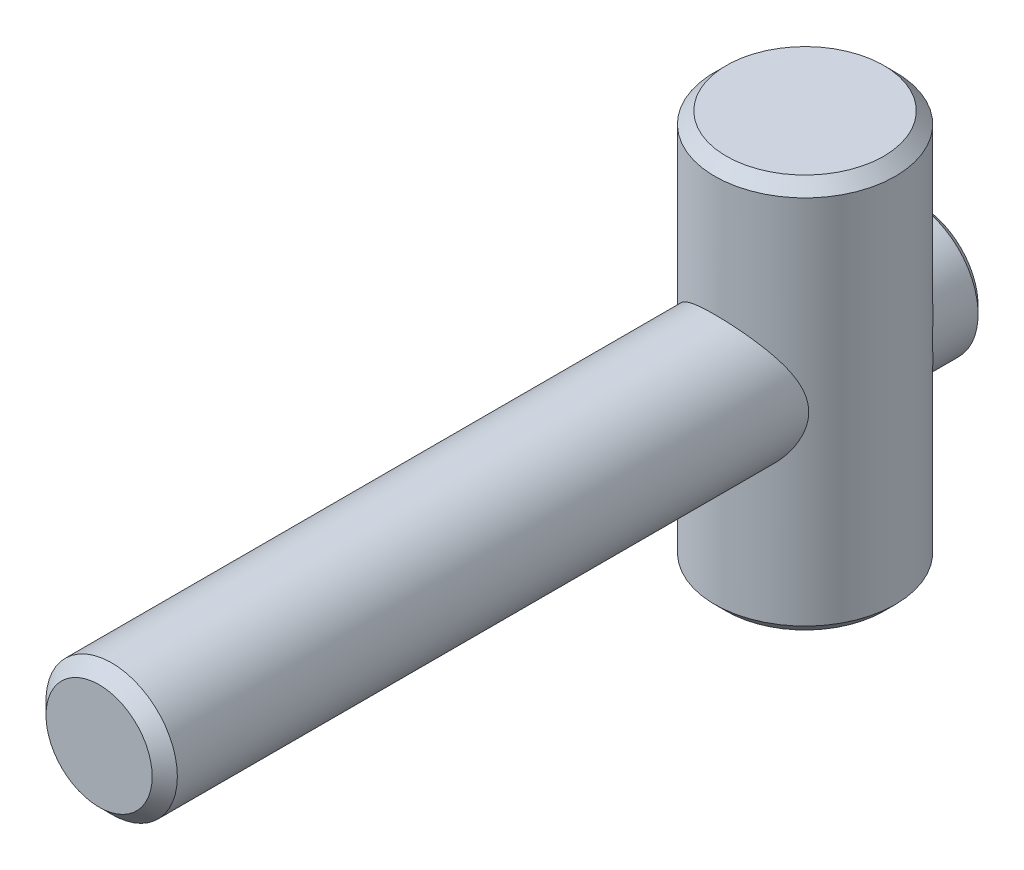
ISO-10303-21;
HEADER;
FILE_DESCRIPTION(('STEP AP214'),'2;1');
FILE_NAME('part.step','',(''),(''),'','','');
FILE_SCHEMA(('AUTOMOTIVE_DESIGN { 1 0 10303 214 1 1 1 1 }'));
ENDSEC;
DATA;
#1=APPLICATION_CONTEXT('core data for automotive mechanical design processes');
#2=APPLICATION_PROTOCOL_DEFINITION('international standard','automotive_design',2000,#1);
#3=PRODUCT_CONTEXT('',#1,'mechanical');
#4=PRODUCT('Part','Part','',(#3));
#5=PRODUCT_RELATED_PRODUCT_CATEGORY('part','',(#4));
#6=PRODUCT_DEFINITION_FORMATION('','',#4);
#7=PRODUCT_DEFINITION_CONTEXT('part definition',#1,'design');
#8=PRODUCT_DEFINITION('design','',#6,#7);
#9=PRODUCT_DEFINITION_SHAPE('','',#8);
#10=(LENGTH_UNIT() NAMED_UNIT(*) SI_UNIT(.MILLI.,.METRE.));
#11=(NAMED_UNIT(*) PLANE_ANGLE_UNIT() SI_UNIT($,.RADIAN.));
#12=(NAMED_UNIT(*) SI_UNIT($,.STERADIAN.) SOLID_ANGLE_UNIT());
#13=UNCERTAINTY_MEASURE_WITH_UNIT(LENGTH_MEASURE(1.E-05),#10,'distance_accuracy_value','');
#14=(GEOMETRIC_REPRESENTATION_CONTEXT(3) GLOBAL_UNCERTAINTY_ASSIGNED_CONTEXT((#13)) GLOBAL_UNIT_ASSIGNED_CONTEXT((#10,
#11,#12)) REPRESENTATION_CONTEXT('',''));
#15=CARTESIAN_POINT('',(0.,0.,0.));
#16=DIRECTION('',(0.,0.,1.));
#17=DIRECTION('',(1.,0.,0.));
#18=AXIS2_PLACEMENT_3D('',#15,#16,#17);
#19=CARTESIAN_POINT('',(0.,0.,-25.3));
#20=DIRECTION('',(0.,0.,1.));
#21=DIRECTION('',(1.,0.,0.));
#22=AXIS2_PLACEMENT_3D('',#19,#20,#21);
#23=PLANE('',#22);
#24=CARTESIAN_POINT('',(0.,0.,-25.3));
#25=DIRECTION('',(0.,0.,1.));
#26=DIRECTION('',(1.,0.,0.));
#27=AXIS2_PLACEMENT_3D('',#24,#25,#26);
#28=CIRCLE('',#27,3.54);
#29=CARTESIAN_POINT('',(-0.6,3.48878202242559,-25.3));
#30=VERTEX_POINT('',#29);
#31=CARTESIAN_POINT('',(-0.6,-3.48878202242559,-25.3));
#32=VERTEX_POINT('',#31);
#33=EDGE_CURVE('E108',#30,#32,#28,.T.);
#34=ORIENTED_EDGE('',*,*,#33,.F.);
#35=DIRECTION('',(0.,-1.,0.));
#36=VECTOR('',#35,1.);
#37=CARTESIAN_POINT('',(-0.6,0.,-25.3));
#38=LINE('',#37,#36);
#39=EDGE_CURVE('E293',#30,#32,#38,.T.);
#40=ORIENTED_EDGE('',*,*,#39,.T.);
#41=EDGE_LOOP('',(#34,#40));
#42=FACE_BOUND('',#41,.T.);
#43=ADVANCED_FACE('F14',(#42),#23,.F.);
#44=CARTESIAN_POINT('',(0.,0.,-25.3));
#45=DIRECTION('',(0.,0.,1.));
#46=DIRECTION('',(1.,0.,0.));
#47=AXIS2_PLACEMENT_3D('',#44,#45,#46);
#48=CONICAL_SURFACE('',#47,3.54,0.785398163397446);
#49=CARTESIAN_POINT('',(0.,0.,-24.84));
#50=DIRECTION('',(0.,0.,1.));
#51=DIRECTION('',(1.,0.,0.));
#52=AXIS2_PLACEMENT_3D('',#49,#50,#51);
#53=CIRCLE('',#52,4.);
#54=CARTESIAN_POINT('',(-0.6,3.95474398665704,-24.84));
#55=VERTEX_POINT('',#54);
#56=CARTESIAN_POINT('',(-0.6,-3.95474398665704,-24.84));
#57=VERTEX_POINT('',#56);
#58=EDGE_CURVE('E126',#55,#57,#53,.T.);
#59=ORIENTED_EDGE('',*,*,#58,.F.);
#60=CARTESIAN_POINT('',(-0.6,3.9554519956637,-24.8393));
#61=CARTESIAN_POINT('',(-0.6,3.83941046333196,-24.9540237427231));
#62=CARTESIAN_POINT('',(-0.6,3.72331727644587,-25.0686953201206));
#63=CARTESIAN_POINT('',(-0.6,3.49091447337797,-25.2979511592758));
#64=CARTESIAN_POINT('',(-0.6,3.37460477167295,-25.4125353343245));
#65=CARTESIAN_POINT('',(-0.6,3.14054409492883,-25.642725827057));
#66=CARTESIAN_POINT('',(-0.6,3.02279099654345,-25.7583299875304));
#67=CARTESIAN_POINT('',(-0.6,2.78706506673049,-25.9891808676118));
#68=CARTESIAN_POINT('',(-0.6,2.66909239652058,-26.1044277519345));
#69=CARTESIAN_POINT('',(-0.6,2.38769992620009,-26.3783597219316));
#70=CARTESIAN_POINT('',(-0.6,2.2240974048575,-26.536857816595));
#71=CARTESIAN_POINT('',(-0.6,1.97745696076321,-26.7736454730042));
#72=CARTESIAN_POINT('',(-0.6,1.89495476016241,-26.8524926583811));
#73=CARTESIAN_POINT('',(-0.6,1.72944434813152,-27.0096193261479));
#74=CARTESIAN_POINT('',(-0.6,1.64643625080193,-27.0878989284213));
#75=CARTESIAN_POINT('',(-0.6,1.48033289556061,-27.2429690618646));
#76=CARTESIAN_POINT('',(-0.6,1.39724415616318,-27.319766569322));
#77=CARTESIAN_POINT('',(-0.6,1.2297853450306,-27.4721053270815));
#78=CARTESIAN_POINT('',(-0.6,1.14541426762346,-27.5476454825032));
#79=CARTESIAN_POINT('',(-0.6,1.01743134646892,-27.6590099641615));
#80=CARTESIAN_POINT('',(-0.6,0.974611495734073,-27.6957423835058));
#81=CARTESIAN_POINT('',(-0.6,0.88825104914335,-27.7683476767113));
#82=CARTESIAN_POINT('',(-0.6,0.844710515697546,-27.8042206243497));
#83=CARTESIAN_POINT('',(-0.6,0.756681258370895,-27.8746657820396));
#84=CARTESIAN_POINT('',(-0.6,0.712193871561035,-27.9092396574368));
#85=CARTESIAN_POINT('',(-0.6,0.621791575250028,-27.9764590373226));
#86=CARTESIAN_POINT('',(-0.6,0.575877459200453,-28.0091055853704));
#87=CARTESIAN_POINT('',(-0.6,0.517059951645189,-28.0479937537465));
#88=CARTESIAN_POINT('',(-0.6,0.505142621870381,-28.0557273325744));
#89=CARTESIAN_POINT('',(-0.6,0.481156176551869,-28.0709583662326));
#90=CARTESIAN_POINT('',(-0.6,0.469087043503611,-28.0784557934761));
#91=CARTESIAN_POINT('',(-0.6,0.432629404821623,-28.1005451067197));
#92=CARTESIAN_POINT('',(-0.6,0.407992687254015,-28.1147326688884));
#93=CARTESIAN_POINT('',(-0.6,0.358127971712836,-28.1415606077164));
#94=CARTESIAN_POINT('',(-0.6,0.332906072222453,-28.1542121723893));
#95=CARTESIAN_POINT('',(-0.6,0.28159268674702,-28.1776006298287));
#96=CARTESIAN_POINT('',(-0.6,0.255501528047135,-28.1883382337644));
#97=CARTESIAN_POINT('',(-0.6,0.19385499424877,-28.2103112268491));
#98=CARTESIAN_POINT('',(-0.6,0.157946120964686,-28.2206034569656));
#99=CARTESIAN_POINT('',(-0.6,0.0849893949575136,-28.2350528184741));
#100=CARTESIAN_POINT('',(-0.6,0.0479465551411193,-28.2392338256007));
#101=CARTESIAN_POINT('',(-0.6,-0.0264554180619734,-28.2405737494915));
#102=CARTESIAN_POINT('',(-0.6,-0.0638152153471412,-28.237698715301));
#103=CARTESIAN_POINT('',(-0.6,-0.137530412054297,-28.2255268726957));
#104=CARTESIAN_POINT('',(-0.6,-0.173882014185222,-28.2162085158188));
#105=CARTESIAN_POINT('',(-0.6,-0.246261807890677,-28.1923675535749));
#106=CARTESIAN_POINT('',(-0.6,-0.282227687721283,-28.1776642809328));
#107=CARTESIAN_POINT('',(-0.6,-0.352560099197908,-28.1447807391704));
#108=CARTESIAN_POINT('',(-0.6,-0.386923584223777,-28.1265941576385));
#109=CARTESIAN_POINT('',(-0.6,-0.454569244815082,-28.0877625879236));
#110=CARTESIAN_POINT('',(-0.6,-0.487840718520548,-28.0670992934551));
#111=CARTESIAN_POINT('',(-0.6,-0.553299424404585,-28.024199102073));
#112=CARTESIAN_POINT('',(-0.6,-0.585487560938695,-28.0019635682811));
#113=CARTESIAN_POINT('',(-0.6,-0.651811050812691,-27.9544053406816));
#114=CARTESIAN_POINT('',(-0.6,-0.685873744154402,-27.928982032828));
#115=CARTESIAN_POINT('',(-0.6,-0.753285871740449,-27.8772035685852));
#116=CARTESIAN_POINT('',(-0.6,-0.786635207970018,-27.8508482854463));
#117=CARTESIAN_POINT('',(-0.6,-0.885905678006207,-27.7707557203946));
#118=CARTESIAN_POINT('',(-0.6,-0.951015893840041,-27.7160164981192));
#119=CARTESIAN_POINT('',(-0.6,-1.08003348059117,-27.6049240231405));
#120=CARTESIAN_POINT('',(-0.6,-1.14393845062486,-27.5485680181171));
#121=CARTESIAN_POINT('',(-0.6,-1.27086154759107,-27.4349047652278));
#122=CARTESIAN_POINT('',(-0.6,-1.3338799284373,-27.3775978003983));
#123=CARTESIAN_POINT('',(-0.6,-1.4591376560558,-27.2625095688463));
#124=CARTESIAN_POINT('',(-0.6,-1.52137875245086,-27.2047301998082));
#125=CARTESIAN_POINT('',(-0.6,-1.64544200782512,-27.0887149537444));
#126=CARTESIAN_POINT('',(-0.6,-1.70726413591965,-27.0304790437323));
#127=CARTESIAN_POINT('',(-0.6,-1.89214348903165,-26.8554033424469));
#128=CARTESIAN_POINT('',(-0.6,-2.01474045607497,-26.738078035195));
#129=CARTESIAN_POINT('',(-0.6,-2.28982158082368,-26.4732317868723));
#130=CARTESIAN_POINT('',(-0.6,-2.44210553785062,-26.3255035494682));
#131=CARTESIAN_POINT('',(-0.6,-2.74608630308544,-26.0293359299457));
#132=CARTESIAN_POINT('',(-0.6,-2.89778288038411,-25.8808963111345));
#133=CARTESIAN_POINT('',(-0.6,-3.20065551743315,-25.5837234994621));
#134=CARTESIAN_POINT('',(-0.6,-3.35183189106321,-25.4349906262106));
#135=CARTESIAN_POINT('',(-0.6,-3.653848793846,-25.1372979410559));
#136=CARTESIAN_POINT('',(-0.6,-3.80468942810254,-24.9883382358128));
#137=CARTESIAN_POINT('',(-0.6,-3.9554519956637,-24.8393));
#138=B_SPLINE_CURVE_WITH_KNOTS('',3,(#60,#61,#62,#63,#64,#65,#66,#67,#68,#69,#70,#71,#72,#73,
#74,#75,#76,#77,#78,#79,#80,#81,#82,#83,#84,#85,#86,#87,#88,#89,#90,#91,#92,#93,#94,#95,#96,#97,
#98,#99,#100,#101,#102,#103,#104,#105,#106,#107,#108,#109,#110,#111,#112,#113,#114,#115,#116,
#117,#118,#119,#120,#121,#122,#123,#124,#125,#126,#127,#128,#129,#130,#131,#132,#133,#134,#135,
#136,#137),.UNSPECIFIED.,.F.,.F.,(4,2,2,2,2,2,2,2,2,2,2,2,2,2,2,2,2,2,2,2,2,2,2,2,2,2,2,2,2,2,2,
2,2,2,2,2,2,2,4),(0.,0.489535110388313,0.979348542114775,1.47439453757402,1.96916156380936,
2.65251943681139,2.99487953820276,3.33716508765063,3.6765918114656,4.01630008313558,
4.18554223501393,4.35476980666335,4.5237724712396,4.69268277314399,4.73530049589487,
4.77792317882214,4.86317585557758,4.94776464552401,5.03232193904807,5.14397626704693,
5.25519319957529,5.36694631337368,5.47907498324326,5.5953739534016,5.71188570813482,
5.82931897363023,5.94665164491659,6.07414183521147,6.20164943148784,6.45678921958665,
6.71239265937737,6.96792134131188,7.22269628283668,7.47748980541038,7.98655823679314,
8.62305059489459,9.25977190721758,9.89599619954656,10.5319807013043),.UNSPECIFIED.);
#139=EDGE_CURVE('E291',#55,#30,#138,.T.);
#140=ORIENTED_EDGE('',*,*,#139,.T.);
#141=ORIENTED_EDGE('',*,*,#33,.T.);
#142=EDGE_CURVE('E295',#32,#57,#138,.T.);
#143=ORIENTED_EDGE('',*,*,#142,.T.);
#144=EDGE_LOOP('',(#59,#140,#141,#143));
#145=FACE_BOUND('',#144,.T.);
#146=ADVANCED_FACE('F232',(#145),#48,.T.);
#147=CARTESIAN_POINT('',(0.,0.,-12.8));
#148=DIRECTION('',(0.,0.,1.));
#149=DIRECTION('',(1.,0.,0.));
#150=AXIS2_PLACEMENT_3D('',#147,#148,#149);
#151=CYLINDRICAL_SURFACE('',#150,4.);
#152=CARTESIAN_POINT('',(4.,0.,-22.0749172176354));
#153=CARTESIAN_POINT('',(3.99999971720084,0.094559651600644,-22.0749177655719));
#154=CARTESIAN_POINT('',(3.99663873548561,0.189122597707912,-22.078488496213));
#155=CARTESIAN_POINT('',(3.98328406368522,0.377297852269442,-22.0925637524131));
#156=CARTESIAN_POINT('',(3.97328671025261,0.470909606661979,-22.1030721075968));
#157=CARTESIAN_POINT('',(3.94687649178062,0.65648336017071,-22.1304732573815));
#158=CARTESIAN_POINT('',(3.93044906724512,0.748441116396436,-22.1473805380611));
#159=CARTESIAN_POINT('',(3.89152450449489,0.929870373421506,-22.1867470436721));
#160=CARTESIAN_POINT('',(3.86902376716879,1.01934036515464,-22.2092095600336));
#161=CARTESIAN_POINT('',(3.79365509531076,1.28093397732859,-22.2828450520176));
#162=CARTESIAN_POINT('',(3.73252985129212,1.44885844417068,-22.3407009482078));
#163=CARTESIAN_POINT('',(3.590688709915,1.77146295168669,-22.4672506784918));
#164=CARTESIAN_POINT('',(3.50997431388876,1.92614400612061,-22.5359436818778));
#165=CARTESIAN_POINT('',(3.31318173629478,2.25065582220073,-22.6922095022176));
#166=CARTESIAN_POINT('',(3.19328494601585,2.41764951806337,-22.7808675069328));
#167=CARTESIAN_POINT('',(2.92908108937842,2.73178094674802,-22.9578760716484));
#168=CARTESIAN_POINT('',(2.78474090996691,2.87889125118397,-23.0462260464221));
#169=CARTESIAN_POINT('',(2.5362822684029,3.09553636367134,-23.1814353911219));
#170=CARTESIAN_POINT('',(2.43963284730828,3.17231415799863,-23.2305740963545));
#171=CARTESIAN_POINT('',(2.23844845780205,3.31733570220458,-23.3251054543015));
#172=CARTESIAN_POINT('',(2.13391712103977,3.38558334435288,-23.3704998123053));
#173=CARTESIAN_POINT('',(1.91752007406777,3.51266692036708,-23.4562228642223));
#174=CARTESIAN_POINT('',(1.80566515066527,3.57151627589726,-23.49655876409));
#175=CARTESIAN_POINT('',(1.57523382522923,3.67896799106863,-23.5709873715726));
#176=CARTESIAN_POINT('',(1.45666071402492,3.72757531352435,-23.6050831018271));
#177=CARTESIAN_POINT('',(1.16188171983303,3.83193503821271,-23.678830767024));
#178=CARTESIAN_POINT('',(0.982606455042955,3.88193864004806,-23.7146815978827));
#179=CARTESIAN_POINT('',(0.616370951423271,3.95663720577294,-23.7684829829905));
#180=CARTESIAN_POINT('',(0.429417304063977,3.98135342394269,-23.7864485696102));
#181=CARTESIAN_POINT('',(0.052567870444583,4.00411402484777,-23.8029868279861));
#182=CARTESIAN_POINT('',(-0.137333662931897,4.00209732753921,-23.8015150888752));
#183=CARTESIAN_POINT('',(-0.51380986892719,3.97135939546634,-23.7791958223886));
#184=CARTESIAN_POINT('',(-0.700383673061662,3.94263129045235,-23.7583433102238));
#185=CARTESIAN_POINT('',(-1.05962164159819,3.86136821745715,-23.699944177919));
#186=CARTESIAN_POINT('',(-1.23253206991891,3.80954610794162,-23.6628980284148));
#187=CARTESIAN_POINT('',(-1.56671343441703,3.68473335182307,-23.5749694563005));
#188=CARTESIAN_POINT('',(-1.72798199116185,3.61173839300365,-23.5240842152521));
#189=CARTESIAN_POINT('',(-2.05370310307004,3.43803005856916,-23.4054456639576));
#190=CARTESIAN_POINT('',(-2.2165364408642,3.33514439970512,-23.3364494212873));
#191=CARTESIAN_POINT('',(-2.52348319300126,3.10940476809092,-23.189889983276));
#192=CARTESIAN_POINT('',(-2.66757825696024,2.98653148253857,-23.1123185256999));
#193=CARTESIAN_POINT('',(-2.96150593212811,2.69807007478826,-22.9383041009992));
#194=CARTESIAN_POINT('',(-3.10726104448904,2.52879913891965,-22.8410685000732));
#195=CARTESIAN_POINT('',(-3.36953999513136,2.16705523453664,-22.6499971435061));
#196=CARTESIAN_POINT('',(-3.48605965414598,1.97457895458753,-22.556161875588));
#197=CARTESIAN_POINT('',(-3.66526169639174,1.61165125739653,-22.402032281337));
#198=CARTESIAN_POINT('',(-3.73414032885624,1.44549066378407,-22.3388789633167));
#199=CARTESIAN_POINT('',(-3.84985589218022,1.10068331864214,-22.2287430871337));
#200=CARTESIAN_POINT('',(-3.89674227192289,0.922065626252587,-22.1817243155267));
#201=CARTESIAN_POINT('',(-3.9599937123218,0.585461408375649,-22.1170906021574));
#202=CARTESIAN_POINT('',(-3.98009730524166,0.428880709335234,-22.0959235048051));
#203=CARTESIAN_POINT('',(-4.00152507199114,0.113064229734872,-22.0733369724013));
#204=CARTESIAN_POINT('',(-4.00286519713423,-0.0461691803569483,-22.0719007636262));
#205=CARTESIAN_POINT('',(-3.98669865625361,-0.362327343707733,-22.0889767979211));
#206=CARTESIAN_POINT('',(-3.96921589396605,-0.519254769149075,-22.1074637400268));
#207=CARTESIAN_POINT('',(-3.91666535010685,-0.82717652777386,-22.1614916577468));
#208=CARTESIAN_POINT('',(-3.88157034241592,-0.978161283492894,-22.1970590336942));
#209=CARTESIAN_POINT('',(-3.77812999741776,-1.33113055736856,-22.2978469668));
#210=CARTESIAN_POINT('',(-3.70207893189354,-1.52906623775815,-22.3692423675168));
#211=CARTESIAN_POINT('',(-3.52270580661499,-1.90640842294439,-22.5254840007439));
#212=CARTESIAN_POINT('',(-3.41932922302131,-2.08577687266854,-22.6103569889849));
#213=CARTESIAN_POINT('',(-3.18411833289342,-2.43025180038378,-22.7870574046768));
#214=CARTESIAN_POINT('',(-3.05152555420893,-2.59477148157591,-22.8790168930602));
#215=CARTESIAN_POINT('',(-2.76125147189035,-2.90173861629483,-23.059699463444));
#216=CARTESIAN_POINT('',(-2.6035911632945,-3.04420434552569,-23.1484251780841));
#217=CARTESIAN_POINT('',(-2.271539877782,-3.2987599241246,-23.3122631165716));
#218=CARTESIAN_POINT('',(-2.09818660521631,-3.41190835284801,-23.3878018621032));
#219=CARTESIAN_POINT('',(-1.82330793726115,-3.56180731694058,-23.4899086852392));
#220=CARTESIAN_POINT('',(-1.72916099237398,-3.6084863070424,-23.5220894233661));
#221=CARTESIAN_POINT('',(-1.53632285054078,-3.69470582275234,-23.5820343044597));
#222=CARTESIAN_POINT('',(-1.43763386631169,-3.73424977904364,-23.6098005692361));
#223=CARTESIAN_POINT('',(-1.23534308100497,-3.80598862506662,-23.6604944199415));
#224=CARTESIAN_POINT('',(-1.13170490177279,-3.83811376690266,-23.683375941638));
#225=CARTESIAN_POINT('',(-0.921160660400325,-3.89401032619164,-23.7233693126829));
#226=CARTESIAN_POINT('',(-0.81425636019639,-3.9177861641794,-23.7404842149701));
#227=CARTESIAN_POINT('',(-0.598125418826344,-3.95655048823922,-23.7684652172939));
#228=CARTESIAN_POINT('',(-0.488900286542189,-3.9715445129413,-23.7793352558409));
#229=CARTESIAN_POINT('',(-0.269138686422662,-3.9924605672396,-23.7945144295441));
#230=CARTESIAN_POINT('',(-0.15860243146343,-3.99838404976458,-23.7988246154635));
#231=CARTESIAN_POINT('',(0.0467313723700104,-4.00084937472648,-23.8006178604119));
#232=CARTESIAN_POINT('',(0.141509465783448,-3.99861635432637,-23.7989924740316));
#233=CARTESIAN_POINT('',(0.330490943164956,-3.98744748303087,-23.7908762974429));
#234=CARTESIAN_POINT('',(0.424694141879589,-3.97850957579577,-23.7843840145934));
#235=CARTESIAN_POINT('',(0.611759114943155,-3.95406659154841,-23.7666782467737));
#236=CARTESIAN_POINT('',(0.704621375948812,-3.93856396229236,-23.7554665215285));
#237=CARTESIAN_POINT('',(0.88841574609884,-3.90122128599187,-23.7285691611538));
#238=CARTESIAN_POINT('',(0.979347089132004,-3.87937877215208,-23.7128817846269));
#239=CARTESIAN_POINT('',(1.24445933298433,-3.80583624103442,-23.6603363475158));
#240=CARTESIAN_POINT('',(1.41518501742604,-3.74554675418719,-23.6175701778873));
#241=CARTESIAN_POINT('',(1.74369677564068,-3.60438289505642,-23.5191022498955));
#242=CARTESIAN_POINT('',(1.90148075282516,-3.5235051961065,-23.4633984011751));
#243=CARTESIAN_POINT('',(2.22228203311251,-3.33179335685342,-23.3343972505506));
#244=CARTESIAN_POINT('',(2.38322541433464,-3.21841054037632,-23.2597469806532));
#245=CARTESIAN_POINT('',(2.68497920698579,-2.97136345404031,-23.103106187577));
#246=CARTESIAN_POINT('',(2.82576198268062,-2.8376718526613,-23.0211058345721));
#247=CARTESIAN_POINT('',(3.03332548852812,-2.61000808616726,-22.8888332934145));
#248=CARTESIAN_POINT('',(3.10699576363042,-2.5218601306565,-22.839152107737));
#249=CARTESIAN_POINT('',(3.24665706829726,-2.3393224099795,-22.7403298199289));
#250=CARTESIAN_POINT('',(3.31264615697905,-2.24493107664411,-22.69118885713));
#251=CARTESIAN_POINT('',(3.43660180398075,-2.0501419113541,-22.5948719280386));
#252=CARTESIAN_POINT('',(3.49457298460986,-1.94974758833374,-22.5476948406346));
#253=CARTESIAN_POINT('',(3.6021255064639,-1.74306577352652,-22.4568795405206));
#254=CARTESIAN_POINT('',(3.6517073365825,-1.63677862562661,-22.4132411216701));
#255=CARTESIAN_POINT('',(3.76078752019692,-1.37275858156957,-22.3142162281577));
#256=CARTESIAN_POINT('',(3.81580236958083,-1.21205137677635,-22.2615166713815));
#257=CARTESIAN_POINT('',(3.88309107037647,-0.963817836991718,-22.1952018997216));
#258=CARTESIAN_POINT('',(3.90296834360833,-0.879972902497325,-22.1752342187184));
#259=CARTESIAN_POINT('',(3.93739985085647,-0.710192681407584,-22.1402454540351));
#260=CARTESIAN_POINT('',(3.95195647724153,-0.62425835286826,-22.1252221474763));
#261=CARTESIAN_POINT('',(3.97571410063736,-0.449073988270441,-22.1005263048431));
#262=CARTESIAN_POINT('',(3.98480070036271,-0.359792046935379,-22.0909682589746));
#263=CARTESIAN_POINT('',(3.99694447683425,-0.180341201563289,-22.0781627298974));
#264=CARTESIAN_POINT('',(4.00000026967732,-0.0901720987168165,-22.0749166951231));
#265=CARTESIAN_POINT('',(4.,0.,-22.0749172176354));
#266=B_SPLINE_CURVE_WITH_KNOTS('',3,(#152,#153,#154,#155,#156,#157,#158,#159,#160,#161,#162,
#163,#164,#165,#166,#167,#168,#169,#170,#171,#172,#173,#174,#175,#176,#177,#178,#179,#180,#181,
#182,#183,#184,#185,#186,#187,#188,#189,#190,#191,#192,#193,#194,#195,#196,#197,#198,#199,#200,
#201,#202,#203,#204,#205,#206,#207,#208,#209,#210,#211,#212,#213,#214,#215,#216,#217,#218,#219,
#220,#221,#222,#223,#224,#225,#226,#227,#228,#229,#230,#231,#232,#233,#234,#235,#236,#237,#238,
#239,#240,#241,#242,#243,#244,#245,#246,#247,#248,#249,#250,#251,#252,#253,#254,#255,#256,#257,
#258,#259,#260,#261,#262,#263,#264,#265),.UNSPECIFIED.,.T.,.F.,(4,2,2,2,2,2,2,2,2,2,2,2,2,2,2,2,
2,2,2,2,2,2,2,2,2,2,2,2,2,2,2,2,2,2,2,2,2,2,2,2,2,2,2,2,2,2,2,2,2,2,2,2,2,2,2,2,4),(0.,
0.283560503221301,0.567277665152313,0.851640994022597,1.13617321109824,1.69729774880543,
2.25837929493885,2.92774006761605,3.59801497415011,3.99610080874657,4.39400433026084,
4.79133442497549,5.18847154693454,5.75445889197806,6.31997012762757,6.88677367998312,
7.45372305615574,8.00426875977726,8.5549266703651,9.16646484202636,9.77859745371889,
10.5066073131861,11.2347211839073,11.8047550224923,12.3735009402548,12.8491941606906,
13.3244829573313,13.7991688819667,14.2745908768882,14.94214771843,15.6110467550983,
16.2999460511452,16.9882713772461,17.6463931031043,17.9757519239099,18.3049519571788,
18.6371312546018,18.9691344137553,19.3009279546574,19.6326683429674,19.9167672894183,
20.2009534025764,20.4850336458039,20.7692245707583,21.3249022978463,21.8806698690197,
22.5100347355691,23.1402542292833,23.5154020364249,23.8906444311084,24.2656695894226,
24.6406728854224,25.1720162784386,25.4371121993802,25.7020887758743,25.9724300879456,
26.24283342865),.UNSPECIFIED.);
#267=CARTESIAN_POINT('',(-0.6,3.95474398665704,-23.7671747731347));
#268=VERTEX_POINT('',#267);
#269=CARTESIAN_POINT('',(-0.6,-3.95474398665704,-23.7671747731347));
#270=VERTEX_POINT('',#269);
#271=EDGE_CURVE('E9',#268,#270,#266,.T.);
#272=ORIENTED_EDGE('',*,*,#271,.F.);
#273=DIRECTION('',(0.,0.,1.));
#274=VECTOR('',#273,1.);
#275=CARTESIAN_POINT('',(-0.6,3.95474398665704,-12.8));
#276=LINE('',#275,#274);
#277=EDGE_CURVE('E107',#268,#55,#276,.F.);
#278=ORIENTED_EDGE('',*,*,#277,.T.);
#279=ORIENTED_EDGE('',*,*,#58,.T.);
#280=DIRECTION('',(0.,0.,1.));
#281=VECTOR('',#280,1.);
#282=CARTESIAN_POINT('',(-0.6,-3.95474398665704,-12.8));
#283=LINE('',#282,#281);
#284=EDGE_CURVE('E138',#57,#270,#283,.T.);
#285=ORIENTED_EDGE('',*,*,#284,.T.);
#286=EDGE_LOOP('',(#272,#278,#279,#285));
#287=FACE_BOUND('',#286,.T.);
#288=ADVANCED_FACE('F219',(#287),#151,.T.);
#289=CARTESIAN_POINT('',(-0.6,0.,-54.8));
#290=DIRECTION('',(1.,0.,0.));
#291=DIRECTION('',(0.,-1.,0.));
#292=AXIS2_PLACEMENT_3D('',#289,#290,#291);
#293=CYLINDRICAL_SURFACE('',#292,31.5);
#294=CARTESIAN_POINT('',(0.7202,3.64052452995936,-23.5110789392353));
#295=CARTESIAN_POINT('',(0.629300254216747,3.66094254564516,-23.5134577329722));
#296=CARTESIAN_POINT('',(0.537517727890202,3.67749677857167,-23.515401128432));
#297=CARTESIAN_POINT('',(0.352855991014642,3.70277065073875,-23.5183807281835));
#298=CARTESIAN_POINT('',(0.259976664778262,3.71148945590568,-23.519416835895));
#299=CARTESIAN_POINT('',(0.0755266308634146,3.72089352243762,-23.5205345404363));
#300=CARTESIAN_POINT('',(-0.0160366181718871,3.7217239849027,-23.5206333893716));
#301=CARTESIAN_POINT('',(-0.198893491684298,3.71572448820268,-23.5199199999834));
#302=CARTESIAN_POINT('',(-0.290187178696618,3.70889647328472,-23.5191079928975));
#303=CARTESIAN_POINT('',(-0.438017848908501,3.69161294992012,-23.5170647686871));
#304=CARTESIAN_POINT('',(-0.494837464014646,3.68345523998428,-23.516102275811));
#305=CARTESIAN_POINT('',(-0.607946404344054,3.66419162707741,-23.5138403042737));
#306=CARTESIAN_POINT('',(-0.664235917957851,3.65308681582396,-23.5125409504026));
#307=CARTESIAN_POINT('',(-0.7202,3.64052452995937,-23.5110789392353));
#308=B_SPLINE_CURVE_WITH_KNOTS('',3,(#294,#295,#296,#297,#298,#299,#300,#301,#302,#303,#304,
#305,#306,#307),.UNSPECIFIED.,.F.,.F.,(4,2,2,2,2,2,4),(0.,0.279507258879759,0.559044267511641,
0.833425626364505,1.10773734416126,1.27989541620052,1.45198980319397),.UNSPECIFIED.);
#309=CARTESIAN_POINT('',(0.6,3.66517006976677,-23.5139563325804));
#310=VERTEX_POINT('',#309);
#311=CARTESIAN_POINT('',(-0.6,3.66517006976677,-23.5139563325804));
#312=VERTEX_POINT('',#311);
#313=EDGE_CURVE('E203',#310,#312,#308,.T.);
#314=ORIENTED_EDGE('',*,*,#313,.F.);
#315=CARTESIAN_POINT('',(0.6,0.,-54.8));
#316=DIRECTION('',(-1.,0.,0.));
#317=DIRECTION('',(0.,1.,0.));
#318=AXIS2_PLACEMENT_3D('',#315,#316,#317);
#319=CIRCLE('',#318,31.5);
#320=CARTESIAN_POINT('',(0.6,-3.66517006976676,-23.5139563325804));
#321=VERTEX_POINT('',#320);
#322=EDGE_CURVE('E302',#321,#310,#319,.T.);
#323=ORIENTED_EDGE('',*,*,#322,.F.);
#324=CARTESIAN_POINT('',(-0.7202,-3.64052452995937,-23.5110789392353));
#325=CARTESIAN_POINT('',(-0.629300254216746,-3.66094254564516,-23.5134577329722));
#326=CARTESIAN_POINT('',(-0.537517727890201,-3.67749677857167,-23.515401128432));
#327=CARTESIAN_POINT('',(-0.352855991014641,-3.70277065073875,-23.5183807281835));
#328=CARTESIAN_POINT('',(-0.259976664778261,-3.71148945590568,-23.519416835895));
#329=CARTESIAN_POINT('',(-0.0755266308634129,-3.72089352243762,-23.5205345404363));
#330=CARTESIAN_POINT('',(0.0160366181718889,-3.7217239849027,-23.5206333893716));
#331=CARTESIAN_POINT('',(0.1988934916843,-3.71572448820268,-23.5199199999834));
#332=CARTESIAN_POINT('',(0.29018717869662,-3.70889647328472,-23.5191079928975));
#333=CARTESIAN_POINT('',(0.438017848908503,-3.69161294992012,-23.5170647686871));
#334=CARTESIAN_POINT('',(0.494837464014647,-3.68345523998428,-23.516102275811));
#335=CARTESIAN_POINT('',(0.607946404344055,-3.66419162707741,-23.5138403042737));
#336=CARTESIAN_POINT('',(0.664235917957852,-3.65308681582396,-23.5125409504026));
#337=CARTESIAN_POINT('',(0.7202,-3.64052452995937,-23.5110789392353));
#338=B_SPLINE_CURVE_WITH_KNOTS('',3,(#324,#325,#326,#327,#328,#329,#330,#331,#332,#333,#334,
#335,#336,#337),.UNSPECIFIED.,.F.,.F.,(4,2,2,2,2,2,4),(0.,0.279507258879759,0.559044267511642,
0.833425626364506,1.10773734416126,1.27989541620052,1.45198980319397),.UNSPECIFIED.);
#339=CARTESIAN_POINT('',(-0.6,-3.66517006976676,-23.5139563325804));
#340=VERTEX_POINT('',#339);
#341=EDGE_CURVE('E192',#340,#321,#338,.T.);
#342=ORIENTED_EDGE('',*,*,#341,.F.);
#343=CARTESIAN_POINT('',(-0.6,0.,-54.8));
#344=DIRECTION('',(-1.,0.,0.));
#345=DIRECTION('',(0.,1.,0.));
#346=AXIS2_PLACEMENT_3D('',#343,#344,#345);
#347=CIRCLE('',#346,31.5);
#348=EDGE_CURVE('E119',#340,#312,#347,.T.);
#349=ORIENTED_EDGE('',*,*,#348,.T.);
#350=EDGE_LOOP('',(#314,#323,#342,#349));
#351=FACE_BOUND('',#350,.T.);
#352=ADVANCED_FACE('F214',(#351),#293,.F.);
#353=DIRECTION('',(0.,-1.,0.));
#354=VECTOR('',#353,1.);
#355=CARTESIAN_POINT('',(0.6,0.,-25.3));
#356=LINE('',#355,#354);
#357=CARTESIAN_POINT('',(0.6,3.48878202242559,-25.3));
#358=VERTEX_POINT('',#357);
#359=CARTESIAN_POINT('',(0.6,-3.48878202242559,-25.3));
#360=VERTEX_POINT('',#359);
#361=EDGE_CURVE('E118',#358,#360,#356,.T.);
#362=ORIENTED_EDGE('',*,*,#361,.F.);
#363=EDGE_CURVE('E117',#360,#358,#28,.T.);
#364=ORIENTED_EDGE('',*,*,#363,.F.);
#365=EDGE_LOOP('',(#362,#364));
#366=FACE_BOUND('',#365,.T.);
#367=ADVANCED_FACE('F218',(#366),#23,.F.);
#368=CARTESIAN_POINT('',(0.6,3.9554519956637,-24.8393));
#369=CARTESIAN_POINT('',(0.6,3.83941046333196,-24.9540237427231));
#370=CARTESIAN_POINT('',(0.6,3.72331727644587,-25.0686953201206));
#371=CARTESIAN_POINT('',(0.6,3.49091447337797,-25.2979511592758));
#372=CARTESIAN_POINT('',(0.6,3.37460477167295,-25.4125353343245));
#373=CARTESIAN_POINT('',(0.6,3.14054409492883,-25.642725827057));
#374=CARTESIAN_POINT('',(0.6,3.02279099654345,-25.7583299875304));
#375=CARTESIAN_POINT('',(0.6,2.78706506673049,-25.9891808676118));
#376=CARTESIAN_POINT('',(0.6,2.66909239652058,-26.1044277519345));
#377=CARTESIAN_POINT('',(0.6,2.38769992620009,-26.3783597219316));
#378=CARTESIAN_POINT('',(0.6,2.2240974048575,-26.536857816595));
#379=CARTESIAN_POINT('',(0.6,1.97745696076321,-26.7736454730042));
#380=CARTESIAN_POINT('',(0.6,1.89495476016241,-26.8524926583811));
#381=CARTESIAN_POINT('',(0.6,1.72944434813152,-27.0096193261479));
#382=CARTESIAN_POINT('',(0.6,1.64643625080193,-27.0878989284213));
#383=CARTESIAN_POINT('',(0.6,1.48033289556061,-27.2429690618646));
#384=CARTESIAN_POINT('',(0.6,1.39724415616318,-27.319766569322));
#385=CARTESIAN_POINT('',(0.6,1.2297853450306,-27.4721053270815));
#386=CARTESIAN_POINT('',(0.6,1.14541426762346,-27.5476454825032));
#387=CARTESIAN_POINT('',(0.6,1.01743134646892,-27.6590099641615));
#388=CARTESIAN_POINT('',(0.6,0.974611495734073,-27.6957423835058));
#389=CARTESIAN_POINT('',(0.6,0.88825104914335,-27.7683476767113));
#390=CARTESIAN_POINT('',(0.6,0.844710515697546,-27.8042206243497));
#391=CARTESIAN_POINT('',(0.6,0.756681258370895,-27.8746657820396));
#392=CARTESIAN_POINT('',(0.6,0.712193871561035,-27.9092396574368));
#393=CARTESIAN_POINT('',(0.6,0.621791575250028,-27.9764590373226));
#394=CARTESIAN_POINT('',(0.6,0.575877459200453,-28.0091055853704));
#395=CARTESIAN_POINT('',(0.6,0.517059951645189,-28.0479937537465));
#396=CARTESIAN_POINT('',(0.6,0.505142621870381,-28.0557273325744));
#397=CARTESIAN_POINT('',(0.6,0.481156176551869,-28.0709583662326));
#398=CARTESIAN_POINT('',(0.6,0.469087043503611,-28.0784557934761));
#399=CARTESIAN_POINT('',(0.6,0.432629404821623,-28.1005451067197));
#400=CARTESIAN_POINT('',(0.6,0.407992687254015,-28.1147326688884));
#401=CARTESIAN_POINT('',(0.6,0.358127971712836,-28.1415606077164));
#402=CARTESIAN_POINT('',(0.6,0.332906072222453,-28.1542121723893));
#403=CARTESIAN_POINT('',(0.6,0.28159268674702,-28.1776006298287));
#404=CARTESIAN_POINT('',(0.6,0.255501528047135,-28.1883382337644));
#405=CARTESIAN_POINT('',(0.6,0.19385499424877,-28.2103112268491));
#406=CARTESIAN_POINT('',(0.6,0.157946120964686,-28.2206034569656));
#407=CARTESIAN_POINT('',(0.6,0.0849893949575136,-28.2350528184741));
#408=CARTESIAN_POINT('',(0.6,0.0479465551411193,-28.2392338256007));
#409=CARTESIAN_POINT('',(0.6,-0.0264554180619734,-28.2405737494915));
#410=CARTESIAN_POINT('',(0.6,-0.0638152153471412,-28.237698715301));
#411=CARTESIAN_POINT('',(0.6,-0.137530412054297,-28.2255268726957));
#412=CARTESIAN_POINT('',(0.6,-0.173882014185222,-28.2162085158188));
#413=CARTESIAN_POINT('',(0.6,-0.246261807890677,-28.1923675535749));
#414=CARTESIAN_POINT('',(0.6,-0.282227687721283,-28.1776642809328));
#415=CARTESIAN_POINT('',(0.6,-0.352560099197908,-28.1447807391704));
#416=CARTESIAN_POINT('',(0.6,-0.386923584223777,-28.1265941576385));
#417=CARTESIAN_POINT('',(0.6,-0.454569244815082,-28.0877625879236));
#418=CARTESIAN_POINT('',(0.6,-0.487840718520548,-28.0670992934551));
#419=CARTESIAN_POINT('',(0.6,-0.553299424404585,-28.024199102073));
#420=CARTESIAN_POINT('',(0.6,-0.585487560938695,-28.0019635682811));
#421=CARTESIAN_POINT('',(0.6,-0.651811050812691,-27.9544053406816));
#422=CARTESIAN_POINT('',(0.6,-0.685873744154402,-27.928982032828));
#423=CARTESIAN_POINT('',(0.6,-0.753285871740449,-27.8772035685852));
#424=CARTESIAN_POINT('',(0.6,-0.786635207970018,-27.8508482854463));
#425=CARTESIAN_POINT('',(0.6,-0.885905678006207,-27.7707557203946));
#426=CARTESIAN_POINT('',(0.6,-0.951015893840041,-27.7160164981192));
#427=CARTESIAN_POINT('',(0.6,-1.08003348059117,-27.6049240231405));
#428=CARTESIAN_POINT('',(0.6,-1.14393845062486,-27.5485680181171));
#429=CARTESIAN_POINT('',(0.6,-1.27086154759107,-27.4349047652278));
#430=CARTESIAN_POINT('',(0.6,-1.3338799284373,-27.3775978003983));
#431=CARTESIAN_POINT('',(0.6,-1.4591376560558,-27.2625095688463));
#432=CARTESIAN_POINT('',(0.6,-1.52137875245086,-27.2047301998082));
#433=CARTESIAN_POINT('',(0.6,-1.64544200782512,-27.0887149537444));
#434=CARTESIAN_POINT('',(0.6,-1.70726413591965,-27.0304790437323));
#435=CARTESIAN_POINT('',(0.6,-1.89214348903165,-26.8554033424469));
#436=CARTESIAN_POINT('',(0.6,-2.01474045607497,-26.738078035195));
#437=CARTESIAN_POINT('',(0.6,-2.28982158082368,-26.4732317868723));
#438=CARTESIAN_POINT('',(0.6,-2.44210553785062,-26.3255035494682));
#439=CARTESIAN_POINT('',(0.6,-2.74608630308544,-26.0293359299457));
#440=CARTESIAN_POINT('',(0.6,-2.89778288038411,-25.8808963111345));
#441=CARTESIAN_POINT('',(0.6,-3.20065551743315,-25.5837234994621));
#442=CARTESIAN_POINT('',(0.6,-3.35183189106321,-25.4349906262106));
#443=CARTESIAN_POINT('',(0.6,-3.653848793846,-25.1372979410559));
#444=CARTESIAN_POINT('',(0.6,-3.80468942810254,-24.9883382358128));
#445=CARTESIAN_POINT('',(0.6,-3.9554519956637,-24.8393));
#446=B_SPLINE_CURVE_WITH_KNOTS('',3,(#368,#369,#370,#371,#372,#373,#374,#375,#376,#377,#378,
#379,#380,#381,#382,#383,#384,#385,#386,#387,#388,#389,#390,#391,#392,#393,#394,#395,#396,#397,
#398,#399,#400,#401,#402,#403,#404,#405,#406,#407,#408,#409,#410,#411,#412,#413,#414,#415,#416,
#417,#418,#419,#420,#421,#422,#423,#424,#425,#426,#427,#428,#429,#430,#431,#432,#433,#434,#435,
#436,#437,#438,#439,#440,#441,#442,#443,#444,#445),.UNSPECIFIED.,.F.,.F.,(4,2,2,2,2,2,2,2,2,2,2,
2,2,2,2,2,2,2,2,2,2,2,2,2,2,2,2,2,2,2,2,2,2,2,2,2,2,2,4),(0.,0.489535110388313,
0.979348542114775,1.47439453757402,1.96916156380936,2.65251943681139,2.99487953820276,
3.33716508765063,3.6765918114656,4.01630008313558,4.18554223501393,4.35476980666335,
4.5237724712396,4.69268277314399,4.73530049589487,4.77792317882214,4.86317585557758,
4.94776464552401,5.03232193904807,5.14397626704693,5.25519319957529,5.36694631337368,
5.47907498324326,5.5953739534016,5.71188570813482,5.82931897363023,5.94665164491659,
6.07414183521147,6.20164943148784,6.45678921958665,6.71239265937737,6.96792134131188,
7.22269628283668,7.47748980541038,7.98655823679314,8.62305059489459,9.25977190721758,
9.89599619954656,10.5319807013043),.UNSPECIFIED.);
#447=CARTESIAN_POINT('',(0.6,3.95474398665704,-24.84));
#448=VERTEX_POINT('',#447);
#449=EDGE_CURVE('E99',#448,#358,#446,.T.);
#450=ORIENTED_EDGE('',*,*,#449,.F.);
#451=CARTESIAN_POINT('',(0.6,-3.95474398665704,-24.84));
#452=VERTEX_POINT('',#451);
#453=EDGE_CURVE('E115',#452,#448,#53,.T.);
#454=ORIENTED_EDGE('',*,*,#453,.F.);
#455=EDGE_CURVE('E121',#360,#452,#446,.T.);
#456=ORIENTED_EDGE('',*,*,#455,.F.);
#457=ORIENTED_EDGE('',*,*,#363,.T.);
#458=EDGE_LOOP('',(#450,#454,#456,#457));
#459=FACE_BOUND('',#458,.T.);
#460=ADVANCED_FACE('F113',(#459),#48,.T.);
#461=CARTESIAN_POINT('',(0.6,-3.95474398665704,-23.7671747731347));
#462=VERTEX_POINT('',#461);
#463=CARTESIAN_POINT('',(0.6,3.95474398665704,-23.7671747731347));
#464=VERTEX_POINT('',#463);
#465=EDGE_CURVE('E28',#462,#464,#266,.T.);
#466=ORIENTED_EDGE('',*,*,#465,.F.);
#467=DIRECTION('',(0.,0.,1.));
#468=VECTOR('',#467,1.);
#469=CARTESIAN_POINT('',(0.6,-3.95474398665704,-12.8));
#470=LINE('',#469,#468);
#471=EDGE_CURVE('E125',#452,#462,#470,.T.);
#472=ORIENTED_EDGE('',*,*,#471,.F.);
#473=ORIENTED_EDGE('',*,*,#453,.T.);
#474=DIRECTION('',(0.,0.,1.));
#475=VECTOR('',#474,1.);
#476=CARTESIAN_POINT('',(0.6,3.95474398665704,-12.8));
#477=LINE('',#476,#475);
#478=EDGE_CURVE('E96',#464,#448,#477,.F.);
#479=ORIENTED_EDGE('',*,*,#478,.F.);
#480=EDGE_LOOP('',(#466,#472,#473,#479));
#481=FACE_BOUND('',#480,.T.);
#482=ADVANCED_FACE('F123',(#481),#151,.T.);
#483=CARTESIAN_POINT('',(0.6,0.,-54.8));
#484=DIRECTION('',(-1.,0.,0.));
#485=DIRECTION('',(0.,1.,0.));
#486=AXIS2_PLACEMENT_3D('',#483,#484,#485);
#487=PLANE('',#486);
#488=CARTESIAN_POINT('',(0.6,5.24144856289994,-25.0756784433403));
#489=CARTESIAN_POINT('',(0.6,4.98335054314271,-24.8193092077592));
#490=CARTESIAN_POINT('',(0.6,4.72517898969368,-24.5630130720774));
#491=CARTESIAN_POINT('',(0.6,4.20843297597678,-24.0508330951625));
#492=CARTESIAN_POINT('',(0.6,3.94985852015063,-23.7949492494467));
#493=CARTESIAN_POINT('',(0.6,3.56149681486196,-23.411626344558));
#494=CARTESIAN_POINT('',(0.6,3.43195870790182,-23.2839350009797));
#495=CARTESIAN_POINT('',(0.6,3.17264289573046,-23.0287963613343));
#496=CARTESIAN_POINT('',(0.6,3.04286519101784,-22.9013490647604));
#497=CARTESIAN_POINT('',(0.6,2.78297398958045,-22.6467936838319));
#498=CARTESIAN_POINT('',(0.6,2.65286048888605,-22.5196856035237));
#499=CARTESIAN_POINT('',(0.6,2.39209410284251,-22.2660223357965));
#500=CARTESIAN_POINT('',(0.6,2.26144121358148,-22.139467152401));
#501=CARTESIAN_POINT('',(0.6,2.13041700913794,-22.0132954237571));
#502=B_SPLINE_CURVE_WITH_KNOTS('',3,(#488,#489,#490,#491,#492,#493,#494,#495,#496,#497,#498,
#499,#500,#501),.UNSPECIFIED.,.F.,.F.,(4,2,2,2,2,2,4),(0.,1.09135708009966,2.18270221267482,
2.72838208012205,3.27406081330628,3.81974602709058,4.36543520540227),.UNSPECIFIED.);
#503=CARTESIAN_POINT('',(0.6,3.92153996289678,-23.7671747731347));
#504=VERTEX_POINT('',#503);
#505=EDGE_CURVE('E185',#504,#310,#502,.T.);
#506=ORIENTED_EDGE('',*,*,#505,.F.);
#507=DIRECTION('',(0.,1.,0.));
#508=VECTOR('',#507,1.);
#509=CARTESIAN_POINT('',(0.6,12.,-23.7671747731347));
#510=LINE('',#509,#508);
#511=EDGE_CURVE('E102',#504,#464,#510,.T.);
#512=ORIENTED_EDGE('',*,*,#511,.T.);
#513=ORIENTED_EDGE('',*,*,#478,.T.);
#514=ORIENTED_EDGE('',*,*,#449,.T.);
#515=ORIENTED_EDGE('',*,*,#361,.T.);
#516=ORIENTED_EDGE('',*,*,#455,.T.);
#517=ORIENTED_EDGE('',*,*,#471,.T.);
#518=CARTESIAN_POINT('',(0.6,-3.92153996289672,-23.7671747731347));
#519=VERTEX_POINT('',#518);
#520=EDGE_CURVE('E149',#462,#519,#510,.T.);
#521=ORIENTED_EDGE('',*,*,#520,.T.);
#522=CARTESIAN_POINT('',(0.6,-2.13041700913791,-22.0132954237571));
#523=CARTESIAN_POINT('',(0.6,-2.20825937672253,-22.088230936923));
#524=CARTESIAN_POINT('',(0.6,-2.2859592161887,-22.1633140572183));
#525=CARTESIAN_POINT('',(0.6,-2.44113254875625,-22.3137133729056));
#526=CARTESIAN_POINT('',(0.6,-2.51860604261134,-22.3890295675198));
#527=CARTESIAN_POINT('',(0.6,-2.75077459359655,-22.6152340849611));
#528=CARTESIAN_POINT('',(0.6,-2.90521897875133,-22.7663795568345));
#529=CARTESIAN_POINT('',(0.6,-3.21369228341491,-23.06908955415));
#530=CARTESIAN_POINT('',(0.6,-3.36772120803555,-23.2206540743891));
#531=CARTESIAN_POINT('',(0.6,-3.67550250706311,-23.524064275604));
#532=CARTESIAN_POINT('',(0.6,-3.82925488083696,-23.6759099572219));
#533=CARTESIAN_POINT('',(0.6,-4.19294614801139,-24.0355407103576));
#534=CARTESIAN_POINT('',(0.6,-4.40280249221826,-24.2434092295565));
#535=CARTESIAN_POINT('',(0.6,-4.82227635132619,-24.6593903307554));
#536=CARTESIAN_POINT('',(0.6,-5.03189386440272,-24.8675029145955));
#537=CARTESIAN_POINT('',(0.6,-5.24144856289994,-25.0756784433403));
#538=B_SPLINE_CURVE_WITH_KNOTS('',3,(#522,#523,#524,#525,#526,#527,#528,#529,#530,#531,#532,
#533,#534,#535,#536,#537),.UNSPECIFIED.,.F.,.F.,(4,2,2,2,2,2,2,4),(0.,0.324148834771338,
0.64829658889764,1.29658684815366,1.94486909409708,2.59315282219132,3.47929086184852,
4.36543562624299),.UNSPECIFIED.);
#539=EDGE_CURVE('E141',#321,#519,#538,.T.);
#540=ORIENTED_EDGE('',*,*,#539,.F.);
#541=ORIENTED_EDGE('',*,*,#322,.T.);
#542=EDGE_LOOP('',(#506,#512,#513,#514,#515,#516,#517,#521,#540,#541));
#543=FACE_BOUND('',#542,.T.);
#544=ADVANCED_FACE('F98',(#543),#487,.T.);
#545=CARTESIAN_POINT('',(-0.6,0.,-54.8));
#546=DIRECTION('',(-1.,0.,0.));
#547=DIRECTION('',(0.,1.,0.));
#548=AXIS2_PLACEMENT_3D('',#545,#546,#547);
#549=PLANE('',#548);
#550=DIRECTION('',(0.,1.,0.));
#551=VECTOR('',#550,1.);
#552=CARTESIAN_POINT('',(-0.6,12.,-23.7671747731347));
#553=LINE('',#552,#551);
#554=CARTESIAN_POINT('',(-0.6,3.92153996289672,-23.7671747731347));
#555=VERTEX_POINT('',#554);
#556=EDGE_CURVE('E36',#555,#268,#553,.T.);
#557=ORIENTED_EDGE('',*,*,#556,.F.);
#558=CARTESIAN_POINT('',(-0.6,5.24144856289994,-25.0756784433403));
#559=CARTESIAN_POINT('',(-0.6,4.98335054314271,-24.8193092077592));
#560=CARTESIAN_POINT('',(-0.6,4.72517898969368,-24.5630130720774));
#561=CARTESIAN_POINT('',(-0.6,4.20843297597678,-24.0508330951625));
#562=CARTESIAN_POINT('',(-0.6,3.94985852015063,-23.7949492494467));
#563=CARTESIAN_POINT('',(-0.6,3.56149681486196,-23.411626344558));
#564=CARTESIAN_POINT('',(-0.6,3.43195870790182,-23.2839350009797));
#565=CARTESIAN_POINT('',(-0.6,3.17264289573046,-23.0287963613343));
#566=CARTESIAN_POINT('',(-0.6,3.04286519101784,-22.9013490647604));
#567=CARTESIAN_POINT('',(-0.6,2.78297398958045,-22.6467936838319));
#568=CARTESIAN_POINT('',(-0.6,2.65286048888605,-22.5196856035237));
#569=CARTESIAN_POINT('',(-0.6,2.39209410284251,-22.2660223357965));
#570=CARTESIAN_POINT('',(-0.6,2.26144121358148,-22.1394671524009));
#571=CARTESIAN_POINT('',(-0.6,2.13041700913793,-22.0132954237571));
#572=B_SPLINE_CURVE_WITH_KNOTS('',3,(#558,#559,#560,#561,#562,#563,#564,#565,#566,#567,#568,
#569,#570,#571),.UNSPECIFIED.,.F.,.F.,(4,2,2,2,2,2,4),(0.,1.09135708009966,2.18270221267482,
2.72838208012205,3.27406081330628,3.81974602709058,4.36543520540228),.UNSPECIFIED.);
#573=EDGE_CURVE('E209',#555,#312,#572,.T.);
#574=ORIENTED_EDGE('',*,*,#573,.T.);
#575=ORIENTED_EDGE('',*,*,#348,.F.);
#576=CARTESIAN_POINT('',(-0.6,-2.13041700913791,-22.0132954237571));
#577=CARTESIAN_POINT('',(-0.6,-2.20825937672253,-22.088230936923));
#578=CARTESIAN_POINT('',(-0.6,-2.2859592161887,-22.1633140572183));
#579=CARTESIAN_POINT('',(-0.6,-2.44113254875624,-22.3137133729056));
#580=CARTESIAN_POINT('',(-0.6,-2.51860604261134,-22.3890295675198));
#581=CARTESIAN_POINT('',(-0.6,-2.75077459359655,-22.6152340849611));
#582=CARTESIAN_POINT('',(-0.6,-2.90521897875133,-22.7663795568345));
#583=CARTESIAN_POINT('',(-0.6,-3.21369228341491,-23.06908955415));
#584=CARTESIAN_POINT('',(-0.6,-3.36772120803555,-23.2206540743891));
#585=CARTESIAN_POINT('',(-0.6,-3.67550250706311,-23.524064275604));
#586=CARTESIAN_POINT('',(-0.6,-3.82925488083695,-23.6759099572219));
#587=CARTESIAN_POINT('',(-0.6,-4.19294614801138,-24.0355407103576));
#588=CARTESIAN_POINT('',(-0.6,-4.40280249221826,-24.2434092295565));
#589=CARTESIAN_POINT('',(-0.6,-4.82227635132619,-24.6593903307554));
#590=CARTESIAN_POINT('',(-0.6,-5.03189386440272,-24.8675029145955));
#591=CARTESIAN_POINT('',(-0.6,-5.24144856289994,-25.0756784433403));
#592=B_SPLINE_CURVE_WITH_KNOTS('',3,(#576,#577,#578,#579,#580,#581,#582,#583,#584,#585,#586,
#587,#588,#589,#590,#591),.UNSPECIFIED.,.F.,.F.,(4,2,2,2,2,2,2,4),(0.,0.324148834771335,
0.648296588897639,1.29658684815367,1.94486909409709,2.59315282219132,3.47929086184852,
4.36543562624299),.UNSPECIFIED.);
#593=CARTESIAN_POINT('',(-0.6,-3.92153996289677,-23.7671747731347));
#594=VERTEX_POINT('',#593);
#595=EDGE_CURVE('E43',#340,#594,#592,.T.);
#596=ORIENTED_EDGE('',*,*,#595,.T.);
#597=EDGE_CURVE('E350',#270,#594,#553,.T.);
#598=ORIENTED_EDGE('',*,*,#597,.F.);
#599=ORIENTED_EDGE('',*,*,#284,.F.);
#600=ORIENTED_EDGE('',*,*,#142,.F.);
#601=ORIENTED_EDGE('',*,*,#39,.F.);
#602=ORIENTED_EDGE('',*,*,#139,.F.);
#603=ORIENTED_EDGE('',*,*,#277,.F.);
#604=EDGE_LOOP('',(#557,#574,#575,#596,#598,#599,#600,#601,#602,#603));
#605=FACE_BOUND('',#604,.T.);
#606=ADVANCED_FACE('F309',(#605),#549,.F.);
#607=CARTESIAN_POINT('',(0.,0.,23.933));
#608=DIRECTION('',(0.,0.,1.));
#609=DIRECTION('',(1.,0.,0.));
#610=AXIS2_PLACEMENT_3D('',#607,#608,#609);
#611=CIRCLE('',#610,4.);
#612=CARTESIAN_POINT('',(4.,0.,23.933));
#613=VERTEX_POINT('',#612);
#614=EDGE_CURVE('E127',#613,#613,#611,.T.);
#615=ORIENTED_EDGE('',*,*,#614,.F.);
#616=EDGE_LOOP('',(#615));
#617=FACE_BOUND('',#616,.T.);
#618=CARTESIAN_POINT('',(4.,0.,-14.5250827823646));
#619=CARTESIAN_POINT('',(3.99999971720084,-0.0945596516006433,-14.5250822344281));
#620=CARTESIAN_POINT('',(3.99663873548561,-0.189122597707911,-14.521511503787));
#621=CARTESIAN_POINT('',(3.98328406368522,-0.37729785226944,-14.5074362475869));
#622=CARTESIAN_POINT('',(3.97328671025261,-0.470909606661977,-14.4969278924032));
#623=CARTESIAN_POINT('',(3.94687649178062,-0.65648336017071,-14.4695267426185));
#624=CARTESIAN_POINT('',(3.93044906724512,-0.748441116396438,-14.4526194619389));
#625=CARTESIAN_POINT('',(3.89152450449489,-0.929870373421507,-14.4132529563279));
#626=CARTESIAN_POINT('',(3.86902376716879,-1.01934036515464,-14.3907904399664));
#627=CARTESIAN_POINT('',(3.79365509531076,-1.28093397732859,-14.3171549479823));
#628=CARTESIAN_POINT('',(3.73252985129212,-1.44885844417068,-14.2592990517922));
#629=CARTESIAN_POINT('',(3.590688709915,-1.7714629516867,-14.1327493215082));
#630=CARTESIAN_POINT('',(3.50997431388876,-1.92614400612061,-14.0640563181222));
#631=CARTESIAN_POINT('',(3.31318173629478,-2.25065582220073,-13.9077904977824));
#632=CARTESIAN_POINT('',(3.19328494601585,-2.41764951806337,-13.8191324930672));
#633=CARTESIAN_POINT('',(2.92908108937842,-2.73178094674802,-13.6421239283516));
#634=CARTESIAN_POINT('',(2.78474090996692,-2.87889125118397,-13.5537739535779));
#635=CARTESIAN_POINT('',(2.53628226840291,-3.09553636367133,-13.4185646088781));
#636=CARTESIAN_POINT('',(2.43963284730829,-3.17231415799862,-13.3694259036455));
#637=CARTESIAN_POINT('',(2.23844845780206,-3.31733570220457,-13.2748945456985));
#638=CARTESIAN_POINT('',(2.13391712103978,-3.38558334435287,-13.2295001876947));
#639=CARTESIAN_POINT('',(1.91752007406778,-3.51266692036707,-13.1437771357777));
#640=CARTESIAN_POINT('',(1.80566515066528,-3.57151627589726,-13.10344123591));
#641=CARTESIAN_POINT('',(1.57523382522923,-3.67896799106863,-13.0290126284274));
#642=CARTESIAN_POINT('',(1.45666071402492,-3.72757531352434,-12.9949168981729));
#643=CARTESIAN_POINT('',(1.16188171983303,-3.83193503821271,-12.921169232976));
#644=CARTESIAN_POINT('',(0.982606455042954,-3.88193864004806,-12.8853184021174));
#645=CARTESIAN_POINT('',(0.616370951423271,-3.95663720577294,-12.8315170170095));
#646=CARTESIAN_POINT('',(0.429417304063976,-3.98135342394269,-12.8135514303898));
#647=CARTESIAN_POINT('',(0.0525678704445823,-4.00411402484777,-12.7970131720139));
#648=CARTESIAN_POINT('',(-0.137333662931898,-4.00209732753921,-12.7984849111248));
#649=CARTESIAN_POINT('',(-0.51380986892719,-3.97135939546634,-12.8208041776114));
#650=CARTESIAN_POINT('',(-0.700383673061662,-3.94263129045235,-12.8416566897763));
#651=CARTESIAN_POINT('',(-1.05962164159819,-3.86136821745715,-12.900055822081));
#652=CARTESIAN_POINT('',(-1.23253206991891,-3.80954610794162,-12.9371019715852));
#653=CARTESIAN_POINT('',(-1.56671343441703,-3.68473335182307,-13.0250305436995));
#654=CARTESIAN_POINT('',(-1.72798199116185,-3.61173839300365,-13.0759157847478));
#655=CARTESIAN_POINT('',(-2.05370310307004,-3.43803005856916,-13.1945543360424));
#656=CARTESIAN_POINT('',(-2.2165364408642,-3.33514439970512,-13.2635505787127));
#657=CARTESIAN_POINT('',(-2.52348319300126,-3.10940476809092,-13.410110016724));
#658=CARTESIAN_POINT('',(-2.66757825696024,-2.98653148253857,-13.4876814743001));
#659=CARTESIAN_POINT('',(-2.96150593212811,-2.69807007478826,-13.6616958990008));
#660=CARTESIAN_POINT('',(-3.10726104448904,-2.52879913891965,-13.7589314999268));
#661=CARTESIAN_POINT('',(-3.36953999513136,-2.16705523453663,-13.9500028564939));
#662=CARTESIAN_POINT('',(-3.48605965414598,-1.97457895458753,-14.043838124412));
#663=CARTESIAN_POINT('',(-3.66526169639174,-1.61165125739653,-14.197967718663));
#664=CARTESIAN_POINT('',(-3.73414032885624,-1.44549066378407,-14.2611210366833));
#665=CARTESIAN_POINT('',(-3.84985589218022,-1.10068331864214,-14.3712569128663));
#666=CARTESIAN_POINT('',(-3.8967422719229,-0.922065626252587,-14.4182756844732));
#667=CARTESIAN_POINT('',(-3.95999371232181,-0.585461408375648,-14.4829093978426));
#668=CARTESIAN_POINT('',(-3.98009730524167,-0.428880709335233,-14.5040764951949));
#669=CARTESIAN_POINT('',(-4.00152507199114,-0.113064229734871,-14.5266630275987));
#670=CARTESIAN_POINT('',(-4.00286519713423,0.0461691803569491,-14.5280992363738));
#671=CARTESIAN_POINT('',(-3.98669865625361,0.362327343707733,-14.5110232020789));
#672=CARTESIAN_POINT('',(-3.96921589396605,0.519254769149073,-14.4925362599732));
#673=CARTESIAN_POINT('',(-3.91666535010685,0.827176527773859,-14.4385083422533));
#674=CARTESIAN_POINT('',(-3.88157034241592,0.978161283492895,-14.4029409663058));
#675=CARTESIAN_POINT('',(-3.77812999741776,1.33113055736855,-14.3021530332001));
#676=CARTESIAN_POINT('',(-3.70207893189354,1.52906623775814,-14.2307576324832));
#677=CARTESIAN_POINT('',(-3.522705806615,1.90640842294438,-14.0745159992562));
#678=CARTESIAN_POINT('',(-3.41932922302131,2.08577687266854,-13.9896430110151));
#679=CARTESIAN_POINT('',(-3.18411833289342,2.43025180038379,-13.8129425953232));
#680=CARTESIAN_POINT('',(-3.05152555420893,2.59477148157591,-13.7209831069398));
#681=CARTESIAN_POINT('',(-2.76125147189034,2.90173861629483,-13.540300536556));
#682=CARTESIAN_POINT('',(-2.6035911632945,3.04420434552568,-13.4515748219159));
#683=CARTESIAN_POINT('',(-2.271539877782,3.2987599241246,-13.2877368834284));
#684=CARTESIAN_POINT('',(-2.09818660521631,3.41190835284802,-13.2121981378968));
#685=CARTESIAN_POINT('',(-1.82330793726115,3.56180731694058,-13.1100913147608));
#686=CARTESIAN_POINT('',(-1.72916099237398,3.6084863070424,-13.0779105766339));
#687=CARTESIAN_POINT('',(-1.53632285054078,3.69470582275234,-13.0179656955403));
#688=CARTESIAN_POINT('',(-1.43763386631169,3.73424977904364,-12.990199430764));
#689=CARTESIAN_POINT('',(-1.23534308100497,3.80598862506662,-12.9395055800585));
#690=CARTESIAN_POINT('',(-1.13170490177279,3.83811376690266,-12.916624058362));
#691=CARTESIAN_POINT('',(-0.921160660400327,3.89401032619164,-12.8766306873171));
#692=CARTESIAN_POINT('',(-0.814256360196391,3.9177861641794,-12.8595157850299));
#693=CARTESIAN_POINT('',(-0.598125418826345,3.95655048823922,-12.8315347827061));
#694=CARTESIAN_POINT('',(-0.488900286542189,3.9715445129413,-12.8206647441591));
#695=CARTESIAN_POINT('',(-0.269138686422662,3.9924605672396,-12.8054855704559));
#696=CARTESIAN_POINT('',(-0.158602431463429,3.99838404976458,-12.8011753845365));
#697=CARTESIAN_POINT('',(0.046731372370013,4.00084937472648,-12.7993821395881));
#698=CARTESIAN_POINT('',(0.141509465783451,3.99861635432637,-12.8010075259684));
#699=CARTESIAN_POINT('',(0.330490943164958,3.98744748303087,-12.8091237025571));
#700=CARTESIAN_POINT('',(0.424694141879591,3.97850957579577,-12.8156159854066));
#701=CARTESIAN_POINT('',(0.611759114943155,3.95406659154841,-12.8333217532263));
#702=CARTESIAN_POINT('',(0.704621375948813,3.93856396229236,-12.8445334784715));
#703=CARTESIAN_POINT('',(0.88841574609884,3.90122128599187,-12.8714308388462));
#704=CARTESIAN_POINT('',(0.979347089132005,3.87937877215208,-12.8871182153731));
#705=CARTESIAN_POINT('',(1.24445933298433,3.80583624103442,-12.9396636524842));
#706=CARTESIAN_POINT('',(1.41518501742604,3.74554675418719,-12.9824298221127));
#707=CARTESIAN_POINT('',(1.74369677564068,3.60438289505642,-13.0808977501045));
#708=CARTESIAN_POINT('',(1.90148075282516,3.5235051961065,-13.1366015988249));
#709=CARTESIAN_POINT('',(2.22228203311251,3.33179335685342,-13.2656027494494));
#710=CARTESIAN_POINT('',(2.38322541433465,3.21841054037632,-13.3402530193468));
#711=CARTESIAN_POINT('',(2.68497920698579,2.97136345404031,-13.496893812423));
#712=CARTESIAN_POINT('',(2.82576198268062,2.8376718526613,-13.5788941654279));
#713=CARTESIAN_POINT('',(3.03332548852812,2.61000808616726,-13.7111667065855));
#714=CARTESIAN_POINT('',(3.10699576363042,2.5218601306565,-13.760847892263));
#715=CARTESIAN_POINT('',(3.24665706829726,2.33932240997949,-13.8596701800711));
#716=CARTESIAN_POINT('',(3.31264615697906,2.24493107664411,-13.9088111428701));
#717=CARTESIAN_POINT('',(3.43660180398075,2.05014191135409,-14.0051280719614));
#718=CARTESIAN_POINT('',(3.49457298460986,1.94974758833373,-14.0523051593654));
#719=CARTESIAN_POINT('',(3.60212550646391,1.74306577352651,-14.1431204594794));
#720=CARTESIAN_POINT('',(3.65170733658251,1.6367786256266,-14.18675887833));
#721=CARTESIAN_POINT('',(3.76078752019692,1.37275858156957,-14.2857837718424));
#722=CARTESIAN_POINT('',(3.81580236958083,1.21205137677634,-14.3384833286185));
#723=CARTESIAN_POINT('',(3.88309107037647,0.963817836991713,-14.4047981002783));
#724=CARTESIAN_POINT('',(3.90296834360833,0.879972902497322,-14.4247657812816));
#725=CARTESIAN_POINT('',(3.93739985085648,0.71019268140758,-14.4597545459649));
#726=CARTESIAN_POINT('',(3.95195647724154,0.624258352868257,-14.4747778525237));
#727=CARTESIAN_POINT('',(3.97571410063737,0.449073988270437,-14.4994736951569));
#728=CARTESIAN_POINT('',(3.98480070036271,0.359792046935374,-14.5090317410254));
#729=CARTESIAN_POINT('',(3.99694447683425,0.180341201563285,-14.5218372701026));
#730=CARTESIAN_POINT('',(4.00000026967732,0.0901720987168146,-14.525083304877));
#731=CARTESIAN_POINT('',(4.,0.,-14.5250827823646));
#732=B_SPLINE_CURVE_WITH_KNOTS('',3,(#618,#619,#620,#621,#622,#623,#624,#625,#626,#627,#628,
#629,#630,#631,#632,#633,#634,#635,#636,#637,#638,#639,#640,#641,#642,#643,#644,#645,#646,#647,
#648,#649,#650,#651,#652,#653,#654,#655,#656,#657,#658,#659,#660,#661,#662,#663,#664,#665,#666,
#667,#668,#669,#670,#671,#672,#673,#674,#675,#676,#677,#678,#679,#680,#681,#682,#683,#684,#685,
#686,#687,#688,#689,#690,#691,#692,#693,#694,#695,#696,#697,#698,#699,#700,#701,#702,#703,#704,
#705,#706,#707,#708,#709,#710,#711,#712,#713,#714,#715,#716,#717,#718,#719,#720,#721,#722,#723,
#724,#725,#726,#727,#728,#729,#730,#731),.UNSPECIFIED.,.T.,.F.,(4,2,2,2,2,2,2,2,2,2,2,2,2,2,2,2,
2,2,2,2,2,2,2,2,2,2,2,2,2,2,2,2,2,2,2,2,2,2,2,2,2,2,2,2,2,2,2,2,2,2,2,2,2,2,2,2,4),(0.,
0.2835605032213,0.567277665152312,0.851640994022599,1.13617321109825,1.69729774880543,
2.25837929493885,2.92774006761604,3.59801497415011,3.99610080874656,4.39400433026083,
4.79133442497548,5.18847154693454,5.75445889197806,6.31997012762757,6.88677367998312,
7.45372305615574,8.00426875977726,8.5549266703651,9.16646484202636,9.77859745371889,
10.5066073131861,11.2347211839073,11.8047550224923,12.3735009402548,12.8491941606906,
13.3244829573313,13.7991688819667,14.2745908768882,14.94214771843,15.6110467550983,
16.2999460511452,16.9882713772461,17.6463931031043,17.9757519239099,18.3049519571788,
18.6371312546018,18.9691344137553,19.3009279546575,19.6326683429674,19.9167672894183,
20.2009534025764,20.4850336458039,20.7692245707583,21.3249022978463,21.8806698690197,
22.5100347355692,23.1402542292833,23.5154020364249,23.8906444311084,24.2656695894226,
24.6406728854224,25.1720162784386,25.4371121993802,25.7020887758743,25.9724300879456,
26.24283342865),.UNSPECIFIED.);
#733=CARTESIAN_POINT('',(4.,0.,-14.5250827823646));
#734=VERTEX_POINT('',#733);
#735=EDGE_CURVE('E18',#734,#734,#732,.T.);
#736=ORIENTED_EDGE('',*,*,#735,.F.);
#737=EDGE_LOOP('',(#736));
#738=FACE_BOUND('',#737,.T.);
#739=ADVANCED_FACE('F228',(#617,#738),#151,.T.);
#740=CARTESIAN_POINT('',(0.,0.,23.933));
#741=DIRECTION('',(0.,0.,-1.));
#742=DIRECTION('',(-1.,0.,0.));
#743=AXIS2_PLACEMENT_3D('',#740,#741,#742);
#744=CONICAL_SURFACE('',#743,4.,0.785398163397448);
#745=CARTESIAN_POINT('',(0.,0.,24.7));
#746=DIRECTION('',(0.,0.,1.));
#747=DIRECTION('',(1.,0.,0.));
#748=AXIS2_PLACEMENT_3D('',#745,#746,#747);
#749=CIRCLE('',#748,3.233);
#750=CARTESIAN_POINT('',(3.233,0.,24.7));
#751=VERTEX_POINT('',#750);
#752=EDGE_CURVE('E131',#751,#751,#749,.T.);
#753=ORIENTED_EDGE('',*,*,#752,.F.);
#754=EDGE_LOOP('',(#753));
#755=FACE_BOUND('',#754,.T.);
#756=ORIENTED_EDGE('',*,*,#614,.T.);
#757=EDGE_LOOP('',(#756));
#758=FACE_BOUND('',#757,.T.);
#759=ADVANCED_FACE('F225',(#755,#758),#744,.T.);
#760=CARTESIAN_POINT('',(3.233,0.,24.7));
#761=DIRECTION('',(0.,0.,-1.));
#762=DIRECTION('',(-1.,0.,0.));
#763=AXIS2_PLACEMENT_3D('',#760,#761,#762);
#764=PLANE('',#763);
#765=ORIENTED_EDGE('',*,*,#752,.T.);
#766=EDGE_LOOP('',(#765));
#767=FACE_BOUND('',#766,.T.);
#768=ADVANCED_FACE('F221',(#767),#764,.F.);
#769=CARTESIAN_POINT('',(0.,-12.,-18.3));
#770=DIRECTION('',(0.,1.,0.));
#771=DIRECTION('',(1.,0.,0.));
#772=AXIS2_PLACEMENT_3D('',#769,#770,#771);
#773=PLANE('',#772);
#774=CARTESIAN_POINT('',(0.,-12.,-18.3));
#775=DIRECTION('',(0.,1.,0.));
#776=DIRECTION('',(1.,0.,0.));
#777=AXIS2_PLACEMENT_3D('',#774,#775,#776);
#778=CIRCLE('',#777,4.79289321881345);
#779=CARTESIAN_POINT('',(4.79289321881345,-12.,-18.3));
#780=VERTEX_POINT('',#779);
#781=EDGE_CURVE('E267',#780,#780,#778,.T.);
#782=ORIENTED_EDGE('',*,*,#781,.F.);
#783=EDGE_LOOP('',(#782));
#784=FACE_BOUND('',#783,.T.);
#785=ADVANCED_FACE('F16',(#784),#773,.F.);
#786=CARTESIAN_POINT('',(0.,12.,-23.0928932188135));
#787=DIRECTION('',(0.,-1.,0.));
#788=DIRECTION('',(-1.,0.,0.));
#789=AXIS2_PLACEMENT_3D('',#786,#787,#788);
#790=PLANE('',#789);
#791=CARTESIAN_POINT('',(0.,12.,-18.3));
#792=DIRECTION('',(0.,1.,0.));
#793=DIRECTION('',(1.,0.,0.));
#794=AXIS2_PLACEMENT_3D('',#791,#792,#793);
#795=CIRCLE('',#794,4.79289321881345);
#796=CARTESIAN_POINT('',(4.79289321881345,12.,-18.3));
#797=VERTEX_POINT('',#796);
#798=EDGE_CURVE('E275',#797,#797,#795,.T.);
#799=ORIENTED_EDGE('',*,*,#798,.T.);
#800=EDGE_LOOP('',(#799));
#801=FACE_BOUND('',#800,.T.);
#802=ADVANCED_FACE('F162',(#801),#790,.F.);
#803=CARTESIAN_POINT('',(0.,-12.,-18.3));
#804=DIRECTION('',(0.,1.,0.));
#805=DIRECTION('',(1.,0.,0.));
#806=AXIS2_PLACEMENT_3D('',#803,#804,#805);
#807=CONICAL_SURFACE('',#806,4.79289321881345,0.78539816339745);
#808=CARTESIAN_POINT('',(0.,-11.2928932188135,-18.3));
#809=DIRECTION('',(0.,1.,0.));
#810=DIRECTION('',(1.,0.,0.));
#811=AXIS2_PLACEMENT_3D('',#808,#809,#810);
#812=CIRCLE('',#811,5.5);
#813=CARTESIAN_POINT('',(5.5,-11.2928932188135,-18.3));
#814=VERTEX_POINT('',#813);
#815=EDGE_CURVE('E268',#814,#814,#812,.T.);
#816=ORIENTED_EDGE('',*,*,#815,.F.);
#817=EDGE_LOOP('',(#816));
#818=FACE_BOUND('',#817,.T.);
#819=ORIENTED_EDGE('',*,*,#781,.T.);
#820=EDGE_LOOP('',(#819));
#821=FACE_BOUND('',#820,.T.);
#822=ADVANCED_FACE('F244',(#818,#821),#807,.T.);
#823=CARTESIAN_POINT('',(0.,11.2928932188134,-18.3));
#824=DIRECTION('',(0.,-1.,0.));
#825=DIRECTION('',(-1.,0.,0.));
#826=AXIS2_PLACEMENT_3D('',#823,#824,#825);
#827=CONICAL_SURFACE('',#826,5.5,0.785398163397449);
#828=ORIENTED_EDGE('',*,*,#798,.F.);
#829=EDGE_LOOP('',(#828));
#830=FACE_BOUND('',#829,.T.);
#831=CARTESIAN_POINT('',(0.,11.2928932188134,-18.3));
#832=DIRECTION('',(0.,1.,0.));
#833=DIRECTION('',(1.,0.,0.));
#834=AXIS2_PLACEMENT_3D('',#831,#832,#833);
#835=CIRCLE('',#834,5.5);
#836=CARTESIAN_POINT('',(5.5,11.2928932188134,-18.3));
#837=VERTEX_POINT('',#836);
#838=EDGE_CURVE('E271',#837,#837,#835,.T.);
#839=ORIENTED_EDGE('',*,*,#838,.T.);
#840=EDGE_LOOP('',(#839));
#841=FACE_BOUND('',#840,.T.);
#842=ADVANCED_FACE('F242',(#830,#841),#827,.T.);
#843=CARTESIAN_POINT('',(0.,12.,-18.3));
#844=DIRECTION('',(0.,1.,0.));
#845=DIRECTION('',(1.,0.,0.));
#846=AXIS2_PLACEMENT_3D('',#843,#844,#845);
#847=CYLINDRICAL_SURFACE('',#846,5.5);
#848=ORIENTED_EDGE('',*,*,#838,.F.);
#849=EDGE_LOOP('',(#848));
#850=FACE_BOUND('',#849,.T.);
#851=ORIENTED_EDGE('',*,*,#815,.T.);
#852=EDGE_LOOP('',(#851));
#853=FACE_BOUND('',#852,.T.);
#854=ORIENTED_EDGE('',*,*,#271,.T.);
#855=ORIENTED_EDGE('',*,*,#597,.T.);
#856=CARTESIAN_POINT('',(2.17144416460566,-2.81248297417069,-23.3532));
#857=CARTESIAN_POINT('',(2.0690833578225,-2.94700705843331,-23.3971442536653));
#858=CARTESIAN_POINT('',(1.95731490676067,-3.07515187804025,-23.4415267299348));
#859=CARTESIAN_POINT('',(1.7139524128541,-3.31452488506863,-23.5277451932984));
#860=CARTESIAN_POINT('',(1.58217918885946,-3.42557978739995,-23.5695528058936));
#861=CARTESIAN_POINT('',(1.32837400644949,-3.6037499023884,-23.6384435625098));
#862=CARTESIAN_POINT('',(1.20977987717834,-3.67520879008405,-23.6667936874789));
#863=CARTESIAN_POINT('',(0.962048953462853,-3.79911511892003,-23.716673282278));
#864=CARTESIAN_POINT('',(0.832947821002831,-3.85162383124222,-23.7382247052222));
#865=CARTESIAN_POINT('',(0.565167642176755,-3.93463497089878,-23.7725623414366));
#866=CARTESIAN_POINT('',(0.426406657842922,-3.96491514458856,-23.7852599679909));
#867=CARTESIAN_POINT('',(0.145054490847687,-3.99975612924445,-23.7998860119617));
#868=CARTESIAN_POINT('',(0.00246399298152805,-4.00432150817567,-23.8018163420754));
#869=CARTESIAN_POINT('',(-0.262063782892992,-3.98843613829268,-23.7951349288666));
#870=CARTESIAN_POINT('',(-0.384245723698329,-3.97120385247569,-23.7878793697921));
#871=CARTESIAN_POINT('',(-0.623772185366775,-3.91837802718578,-23.7658368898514));
#872=CARTESIAN_POINT('',(-0.741117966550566,-3.88278930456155,-23.751051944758));
#873=CARTESIAN_POINT('',(-0.970983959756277,-3.79456515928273,-23.7148909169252));
#874=CARTESIAN_POINT('',(-1.08334691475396,-3.74158084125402,-23.6933804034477));
#875=CARTESIAN_POINT('',(-1.29927135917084,-3.62137345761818,-23.6454803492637));
#876=CARTESIAN_POINT('',(-1.40281265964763,-3.5541188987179,-23.6190800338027));
#877=CARTESIAN_POINT('',(-1.62977930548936,-3.38608908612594,-23.5546775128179));
#878=CARTESIAN_POINT('',(-1.7498929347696,-3.28130382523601,-23.5155665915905));
#879=CARTESIAN_POINT('',(-1.97310720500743,-3.05696742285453,-23.4352436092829));
#880=CARTESIAN_POINT('',(-2.07631088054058,-2.93751410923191,-23.3940464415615));
#881=CARTESIAN_POINT('',(-2.17144416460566,-2.81248297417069,-23.3532));
#882=B_SPLINE_CURVE_WITH_KNOTS('',3,(#856,#857,#858,#859,#860,#861,#862,#863,#864,#865,#866,
#867,#868,#869,#870,#871,#872,#873,#874,#875,#876,#877,#878,#879,#880,#881),.UNSPECIFIED.,.F.,
.F.,(4,2,2,2,2,2,2,2,2,2,2,2,4),(0.,0.524750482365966,1.05451352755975,1.47691569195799,
1.89793961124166,2.32311787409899,2.74822060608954,3.11728330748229,3.48624921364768,
3.86312036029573,4.24083204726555,4.73148267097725,5.21902256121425),.UNSPECIFIED.);
#883=EDGE_CURVE('E167',#519,#594,#882,.T.);
#884=ORIENTED_EDGE('',*,*,#883,.F.);
#885=ORIENTED_EDGE('',*,*,#520,.F.);
#886=ORIENTED_EDGE('',*,*,#465,.T.);
#887=ORIENTED_EDGE('',*,*,#511,.F.);
#888=CARTESIAN_POINT('',(-2.17144416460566,2.81248297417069,-23.3532));
#889=CARTESIAN_POINT('',(-2.0690833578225,2.94700705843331,-23.3971442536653));
#890=CARTESIAN_POINT('',(-1.95731490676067,3.07515187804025,-23.4415267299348));
#891=CARTESIAN_POINT('',(-1.7139524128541,3.31452488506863,-23.5277451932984));
#892=CARTESIAN_POINT('',(-1.58217918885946,3.42557978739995,-23.5695528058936));
#893=CARTESIAN_POINT('',(-1.32837400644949,3.6037499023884,-23.6384435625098));
#894=CARTESIAN_POINT('',(-1.20977987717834,3.67520879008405,-23.6667936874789));
#895=CARTESIAN_POINT('',(-0.962048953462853,3.79911511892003,-23.716673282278));
#896=CARTESIAN_POINT('',(-0.832947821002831,3.85162383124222,-23.7382247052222));
#897=CARTESIAN_POINT('',(-0.565167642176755,3.93463497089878,-23.7725623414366));
#898=CARTESIAN_POINT('',(-0.426406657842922,3.96491514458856,-23.7852599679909));
#899=CARTESIAN_POINT('',(-0.145054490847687,3.99975612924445,-23.7998860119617));
#900=CARTESIAN_POINT('',(-0.00246399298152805,4.00432150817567,-23.8018163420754));
#901=CARTESIAN_POINT('',(0.262063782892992,3.98843613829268,-23.7951349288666));
#902=CARTESIAN_POINT('',(0.384245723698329,3.97120385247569,-23.7878793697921));
#903=CARTESIAN_POINT('',(0.623772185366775,3.91837802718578,-23.7658368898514));
#904=CARTESIAN_POINT('',(0.741117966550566,3.88278930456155,-23.751051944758));
#905=CARTESIAN_POINT('',(0.970983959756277,3.79456515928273,-23.7148909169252));
#906=CARTESIAN_POINT('',(1.08334691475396,3.74158084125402,-23.6933804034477));
#907=CARTESIAN_POINT('',(1.29927135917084,3.62137345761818,-23.6454803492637));
#908=CARTESIAN_POINT('',(1.40281265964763,3.5541188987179,-23.6190800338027));
#909=CARTESIAN_POINT('',(1.62977930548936,3.38608908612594,-23.5546775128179));
#910=CARTESIAN_POINT('',(1.7498929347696,3.28130382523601,-23.5155665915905));
#911=CARTESIAN_POINT('',(1.97310720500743,3.05696742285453,-23.4352436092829));
#912=CARTESIAN_POINT('',(2.07631088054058,2.93751410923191,-23.3940464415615));
#913=CARTESIAN_POINT('',(2.17144416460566,2.81248297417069,-23.3532));
#914=B_SPLINE_CURVE_WITH_KNOTS('',3,(#888,#889,#890,#891,#892,#893,#894,#895,#896,#897,#898,
#899,#900,#901,#902,#903,#904,#905,#906,#907,#908,#909,#910,#911,#912,#913),.UNSPECIFIED.,.F.,
.F.,(4,2,2,2,2,2,2,2,2,2,2,2,4),(0.,0.524750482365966,1.05451352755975,1.47691569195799,
1.89793961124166,2.32311787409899,2.74822060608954,3.11728330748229,3.48624921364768,
3.86312036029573,4.24083204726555,4.73148267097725,5.21902256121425),.UNSPECIFIED.);
#915=EDGE_CURVE('E177',#555,#504,#914,.T.);
#916=ORIENTED_EDGE('',*,*,#915,.F.);
#917=ORIENTED_EDGE('',*,*,#556,.T.);
#918=EDGE_LOOP('',(#854,#855,#884,#885,#886,#887,#916,#917));
#919=FACE_BOUND('',#918,.T.);
#920=ORIENTED_EDGE('',*,*,#735,.T.);
#921=EDGE_LOOP('',(#920));
#922=FACE_BOUND('',#921,.T.);
#923=ADVANCED_FACE('F239',(#850,#853,#919,#922),#847,.T.);
#924=CARTESIAN_POINT('',(0.,0.,-23.8));
#925=DIRECTION('',(0.,0.,-1.));
#926=DIRECTION('',(-1.,0.,0.));
#927=AXIS2_PLACEMENT_3D('',#924,#925,#926);
#928=CONICAL_SURFACE('',#927,4.,0.785398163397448);
#929=ORIENTED_EDGE('',*,*,#595,.F.);
#930=ORIENTED_EDGE('',*,*,#341,.T.);
#931=ORIENTED_EDGE('',*,*,#539,.T.);
#932=ORIENTED_EDGE('',*,*,#883,.T.);
#933=EDGE_LOOP('',(#929,#930,#931,#932));
#934=FACE_BOUND('',#933,.T.);
#935=ADVANCED_FACE('F159',(#934),#928,.F.);
#936=ORIENTED_EDGE('',*,*,#573,.F.);
#937=ORIENTED_EDGE('',*,*,#915,.T.);
#938=ORIENTED_EDGE('',*,*,#505,.T.);
#939=ORIENTED_EDGE('',*,*,#313,.T.);
#940=EDGE_LOOP('',(#936,#937,#938,#939));
#941=FACE_BOUND('',#940,.T.);
#942=ADVANCED_FACE('F154',(#941),#928,.F.);
#943=CLOSED_SHELL('',(#43,#146,#288,#352,#367,#460,#482,#544,#606,#739,#759,#768,#785,#802,#822,
#842,#923,#935,#942));
#944=MANIFOLD_SOLID_BREP('B1',#943);
#945=ADVANCED_BREP_SHAPE_REPRESENTATION('',(#18,#944),#14);
#946=SHAPE_DEFINITION_REPRESENTATION(#9,#945);
ENDSEC;
END-ISO-10303-21;
